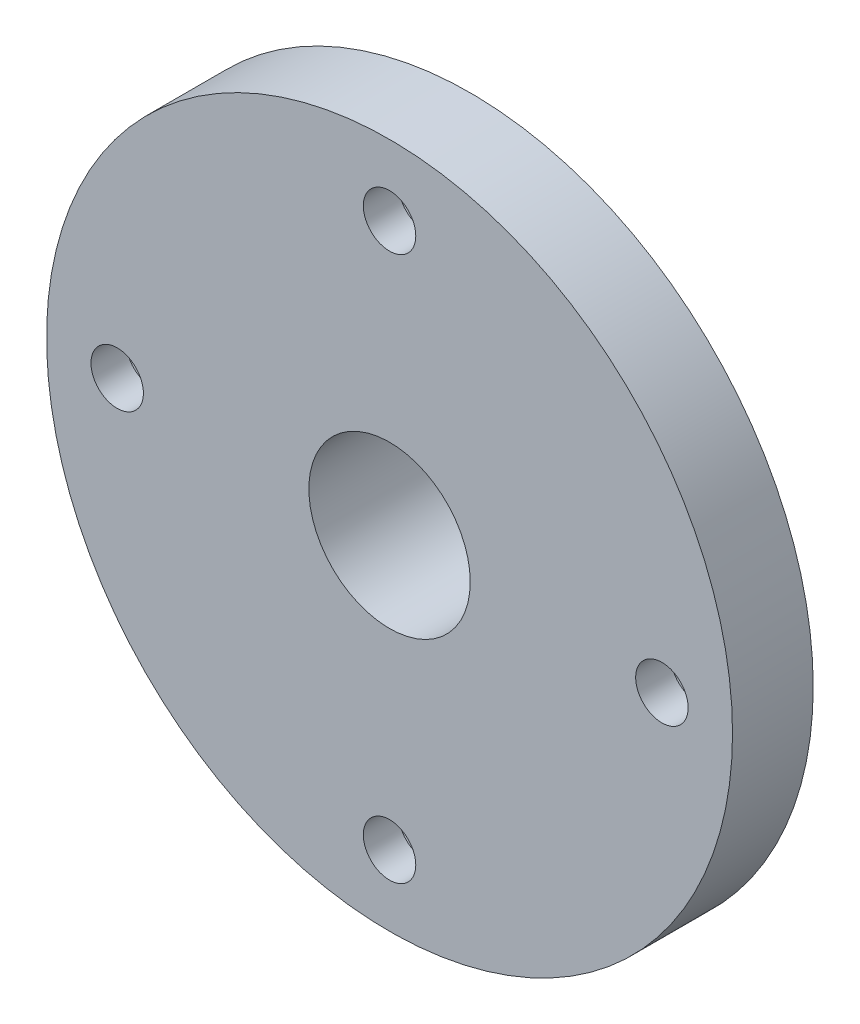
ISO-10303-21;
HEADER;
FILE_DESCRIPTION(('STEP AP214'),'2;1');
FILE_NAME('part.step','',(''),(''),'','','');
FILE_SCHEMA(('AUTOMOTIVE_DESIGN { 1 0 10303 214 1 1 1 1 }'));
ENDSEC;
DATA;
#1=APPLICATION_CONTEXT('core data for automotive mechanical design processes');
#2=APPLICATION_PROTOCOL_DEFINITION('international standard','automotive_design',2000,#1);
#3=PRODUCT_CONTEXT('',#1,'mechanical');
#4=PRODUCT('Part','Part','',(#3));
#5=PRODUCT_RELATED_PRODUCT_CATEGORY('part','',(#4));
#6=PRODUCT_DEFINITION_FORMATION('','',#4);
#7=PRODUCT_DEFINITION_CONTEXT('part definition',#1,'design');
#8=PRODUCT_DEFINITION('design','',#6,#7);
#9=PRODUCT_DEFINITION_SHAPE('','',#8);
#10=(LENGTH_UNIT() NAMED_UNIT(*) SI_UNIT(.MILLI.,.METRE.));
#11=(NAMED_UNIT(*) PLANE_ANGLE_UNIT() SI_UNIT($,.RADIAN.));
#12=(NAMED_UNIT(*) SI_UNIT($,.STERADIAN.) SOLID_ANGLE_UNIT());
#13=UNCERTAINTY_MEASURE_WITH_UNIT(LENGTH_MEASURE(1.E-05),#10,'distance_accuracy_value','');
#14=(GEOMETRIC_REPRESENTATION_CONTEXT(3) GLOBAL_UNCERTAINTY_ASSIGNED_CONTEXT((#13)) GLOBAL_UNIT_ASSIGNED_CONTEXT((#10,
#11,#12)) REPRESENTATION_CONTEXT('',''));
#15=CARTESIAN_POINT('',(0.,0.,0.));
#16=DIRECTION('',(0.,0.,1.));
#17=DIRECTION('',(1.,0.,0.));
#18=AXIS2_PLACEMENT_3D('',#15,#16,#17);
#19=CARTESIAN_POINT('',(0.,0.,0.));
#20=DIRECTION('',(0.,0.,1.));
#21=DIRECTION('',(1.,0.,0.));
#22=AXIS2_PLACEMENT_3D('',#19,#20,#21);
#23=CYLINDRICAL_SURFACE('',#22,12.5);
#24=CARTESIAN_POINT('',(0.,0.,-15.3507658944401));
#25=DIRECTION('',(0.,0.,1.));
#26=DIRECTION('',(1.,0.,0.));
#27=AXIS2_PLACEMENT_3D('',#24,#25,#26);
#28=CIRCLE('',#27,12.5);
#29=CARTESIAN_POINT('',(12.5,0.,-15.3507658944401));
#30=VERTEX_POINT('',#29);
#31=EDGE_CURVE('E57',#30,#30,#28,.F.);
#32=ORIENTED_EDGE('',*,*,#31,.T.);
#33=EDGE_LOOP('',(#32));
#34=FACE_BOUND('',#33,.T.);
#35=CARTESIAN_POINT('',(0.,0.,-18.));
#36=DIRECTION('',(0.,0.,1.));
#37=DIRECTION('',(1.,0.,0.));
#38=AXIS2_PLACEMENT_3D('',#35,#36,#37);
#39=CIRCLE('',#38,12.5);
#40=CARTESIAN_POINT('',(12.5,0.,-18.));
#41=VERTEX_POINT('',#40);
#42=EDGE_CURVE('E69',#41,#41,#39,.T.);
#43=ORIENTED_EDGE('',*,*,#42,.T.);
#44=EDGE_LOOP('',(#43));
#45=FACE_BOUND('',#44,.T.);
#46=ADVANCED_FACE('F43',(#34,#45),#23,.T.);
#47=CARTESIAN_POINT('',(0.,0.,-8.));
#48=DIRECTION('',(0.,0.,1.));
#49=DIRECTION('',(1.,0.,0.));
#50=AXIS2_PLACEMENT_3D('',#47,#48,#49);
#51=CONICAL_SURFACE('',#50,34.,1.43215658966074);
#52=CARTESIAN_POINT('',(-30.4903532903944,-3.58014439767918,-8.46048993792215));
#53=CARTESIAN_POINT('',(-30.5903932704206,-3.48261515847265,-8.44821315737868));
#54=CARTESIAN_POINT('',(-30.6863632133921,-3.38086891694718,-8.43648859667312));
#55=CARTESIAN_POINT('',(-30.8695290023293,-3.16958853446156,-8.41419365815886));
#56=CARTESIAN_POINT('',(-30.956722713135,-3.06005250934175,-8.4036235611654));
#57=CARTESIAN_POINT('',(-31.1217311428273,-2.83389212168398,-8.38368500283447));
#58=CARTESIAN_POINT('',(-31.1995381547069,-2.71726205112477,-8.37431752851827));
#59=CARTESIAN_POINT('',(-31.3451485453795,-2.47776722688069,-8.35683574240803));
#60=CARTESIAN_POINT('',(-31.4129482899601,-2.35490022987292,-8.34872188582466));
#61=CARTESIAN_POINT('',(-31.5379721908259,-2.10391380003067,-8.33379460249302));
#62=CARTESIAN_POINT('',(-31.5952025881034,-1.97579752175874,-8.32698040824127));
#63=CARTESIAN_POINT('',(-31.6987329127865,-1.71510520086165,-8.31467644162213));
#64=CARTESIAN_POINT('',(-31.7450287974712,-1.58252752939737,-8.30918715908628));
#65=CARTESIAN_POINT('',(-31.8262938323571,-1.31398470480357,-8.29956508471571));
#66=CARTESIAN_POINT('',(-31.8612698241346,-1.17802165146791,-8.29543147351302));
#67=CARTESIAN_POINT('',(-31.9196836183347,-0.903552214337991,-8.28853431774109));
#68=CARTESIAN_POINT('',(-31.9431171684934,-0.765044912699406,-8.28577127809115));
#69=CARTESIAN_POINT('',(-31.9781828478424,-0.487075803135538,-8.28163861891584));
#70=CARTESIAN_POINT('',(-31.9898608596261,-0.347619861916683,-8.28026358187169));
#71=CARTESIAN_POINT('',(-32.0014916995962,-0.0681613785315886,-8.27889409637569));
#72=CARTESIAN_POINT('',(-32.001440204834,0.0718413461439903,-8.27890015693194));
#73=CARTESIAN_POINT('',(-31.9896036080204,0.351294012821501,-8.28029387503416));
#74=CARTESIAN_POINT('',(-31.9778225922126,0.490744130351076,-8.28168105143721));
#75=CARTESIAN_POINT('',(-31.9426141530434,0.768197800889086,-8.28583058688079));
#76=CARTESIAN_POINT('',(-31.919182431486,0.906200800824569,-8.28859345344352));
#77=CARTESIAN_POINT('',(-31.8609027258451,1.17944883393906,-8.29547486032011));
#78=CARTESIAN_POINT('',(-31.8260778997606,1.31469887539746,-8.29959065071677));
#79=CARTESIAN_POINT('',(-31.7452435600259,1.58181722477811,-8.30916173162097));
#80=CARTESIAN_POINT('',(-31.6992299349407,1.71368426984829,-8.31461751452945));
#81=CARTESIAN_POINT('',(-31.5963734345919,1.97301588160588,-8.32684112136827));
#82=CARTESIAN_POINT('',(-31.5395345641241,2.10048205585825,-8.33360846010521));
#83=CARTESIAN_POINT('',(-31.4154427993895,2.35017861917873,-8.3484236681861));
#84=CARTESIAN_POINT('',(-31.3481860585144,2.47240705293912,-8.35647201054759));
#85=CARTESIAN_POINT('',(-31.1311906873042,2.83037926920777,-8.38252139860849));
#86=CARTESIAN_POINT('',(-30.9663564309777,3.05708430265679,-8.40241151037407));
#87=CARTESIAN_POINT('',(-30.6015658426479,3.47947078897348,-8.44680657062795));
#88=CARTESIAN_POINT('',(-30.40160871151,3.67515153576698,-8.47131162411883));
#89=CARTESIAN_POINT('',(-29.9710127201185,4.03131963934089,-8.52461951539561));
#90=CARTESIAN_POINT('',(-29.7402071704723,4.19160227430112,-8.55344581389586));
#91=CARTESIAN_POINT('',(-29.2554249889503,4.47117206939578,-8.61470526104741));
#92=CARTESIAN_POINT('',(-29.0014474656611,4.59045765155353,-8.64713854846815));
#93=CARTESIAN_POINT('',(-28.4755408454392,4.78560529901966,-8.71518056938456));
#94=CARTESIAN_POINT('',(-28.2034923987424,4.8611381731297,-8.75081110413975));
#95=CARTESIAN_POINT('',(-27.6508567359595,4.96542731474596,-8.82423558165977));
#96=CARTESIAN_POINT('',(-27.3702691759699,4.99418169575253,-8.86202961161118));
#97=CARTESIAN_POINT('',(-26.806479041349,5.00425636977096,-8.939136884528));
#98=CARTESIAN_POINT('',(-26.5232717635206,4.98524869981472,-8.97845879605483));
#99=CARTESIAN_POINT('',(-25.9641595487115,4.89969621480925,-9.05733624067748));
#100=CARTESIAN_POINT('',(-25.6882548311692,4.83314997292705,-9.09689178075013));
#101=CARTESIAN_POINT('',(-25.1505869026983,4.65405611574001,-9.17522647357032));
#102=CARTESIAN_POINT('',(-24.8888763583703,4.5413489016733,-9.21400243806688));
#103=CARTESIAN_POINT('',(-24.3881107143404,4.27302282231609,-9.28937740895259));
#104=CARTESIAN_POINT('',(-24.1490556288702,4.11740393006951,-9.3259764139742));
#105=CARTESIAN_POINT('',(-23.7010996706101,3.76798830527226,-9.39557704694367));
#106=CARTESIAN_POINT('',(-23.4921224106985,3.57429135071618,-9.42858773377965));
#107=CARTESIAN_POINT('',(-23.1097434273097,3.15382955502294,-9.48977800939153));
#108=CARTESIAN_POINT('',(-22.9363400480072,2.92706625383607,-9.51795782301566));
#109=CARTESIAN_POINT('',(-22.6318006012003,2.44915501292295,-9.56796870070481));
#110=CARTESIAN_POINT('',(-22.500279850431,2.19825830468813,-9.58985735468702));
#111=CARTESIAN_POINT('',(-22.28131457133,1.67743500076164,-9.626561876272));
#112=CARTESIAN_POINT('',(-22.1938664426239,1.40750996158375,-9.64137832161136));
#113=CARTESIAN_POINT('',(-22.0665993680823,0.859974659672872,-9.66301566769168));
#114=CARTESIAN_POINT('',(-22.0261892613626,0.582505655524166,-9.66993578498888));
#115=CARTESIAN_POINT('',(-21.9922589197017,0.0246378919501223,-9.67574303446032));
#116=CARTESIAN_POINT('',(-21.9987360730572,-0.255760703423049,-9.67463061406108));
#117=CARTESIAN_POINT('',(-22.0581352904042,-0.80922634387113,-9.66447523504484));
#118=CARTESIAN_POINT('',(-22.110696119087,-1.08233342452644,-9.65549395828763));
#119=CARTESIAN_POINT('',(-22.2601691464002,-1.61577040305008,-9.63015868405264));
#120=CARTESIAN_POINT('',(-22.3570817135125,-1.87610019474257,-9.61380462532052));
#121=CARTESIAN_POINT('',(-22.5926971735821,-2.37754517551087,-9.57448461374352));
#122=CARTESIAN_POINT('',(-22.7315343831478,-2.61859541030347,-9.55149742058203));
#123=CARTESIAN_POINT('',(-23.0469564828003,-3.07410057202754,-9.49997907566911));
#124=CARTESIAN_POINT('',(-23.223543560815,-3.28855395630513,-9.47144760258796));
#125=CARTESIAN_POINT('',(-23.5137808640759,-3.58691027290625,-9.42525962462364));
#126=CARTESIAN_POINT('',(-23.6154600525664,-3.68299393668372,-9.40918866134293));
#127=CARTESIAN_POINT('',(-23.8264058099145,-3.8662362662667,-9.37610201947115));
#128=CARTESIAN_POINT('',(-23.9356697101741,-3.95339804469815,-9.35908667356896));
#129=CARTESIAN_POINT('',(-24.1610639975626,-4.11824658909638,-9.32426306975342));
#130=CARTESIAN_POINT('',(-24.2771971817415,-4.19592945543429,-9.30645448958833));
#131=CARTESIAN_POINT('',(-24.5154405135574,-4.34124676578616,-9.27021397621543));
#132=CARTESIAN_POINT('',(-24.6375485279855,-4.40888476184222,-9.2517822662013));
#133=CARTESIAN_POINT('',(-24.8884380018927,-4.53444830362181,-9.214218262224));
#134=CARTESIAN_POINT('',(-25.0172822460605,-4.59224668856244,-9.19508019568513));
#135=CARTESIAN_POINT('',(-25.2793054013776,-4.69671110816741,-9.15647956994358));
#136=CARTESIAN_POINT('',(-25.4124827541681,-4.74338109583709,-9.13701712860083));
#137=CARTESIAN_POINT('',(-25.6823283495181,-4.82531147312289,-9.09790329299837));
#138=CARTESIAN_POINT('',(-25.8189978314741,-4.86056774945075,-9.07825183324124));
#139=CARTESIAN_POINT('',(-26.0947712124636,-4.91939341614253,-9.03891739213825));
#140=CARTESIAN_POINT('',(-26.2338742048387,-4.942967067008,-9.01923442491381));
#141=CARTESIAN_POINT('',(-26.5144691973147,-4.97839153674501,-8.97984265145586));
#142=CARTESIAN_POINT('',(-26.655970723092,-4.99016764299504,-8.96013446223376));
#143=CARTESIAN_POINT('',(-26.9394425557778,-5.00164448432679,-8.92095671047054));
#144=CARTESIAN_POINT('',(-27.0814126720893,-5.00134963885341,-8.90148706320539));
#145=CARTESIAN_POINT('',(-27.3649509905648,-4.98868336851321,-8.86289215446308));
#146=CARTESIAN_POINT('',(-27.5065188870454,-4.97630441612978,-8.84376711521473));
#147=CARTESIAN_POINT('',(-27.7880975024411,-4.93953989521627,-8.80599946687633));
#148=CARTESIAN_POINT('',(-27.9281087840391,-4.91515881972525,-8.78735668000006));
#149=CARTESIAN_POINT('',(-28.2056348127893,-4.85454630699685,-8.75065579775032));
#150=CARTESIAN_POINT('',(-28.3431493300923,-4.81831378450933,-8.73259775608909));
#151=CARTESIAN_POINT('',(-28.6146234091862,-4.7342555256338,-8.6971794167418));
#152=CARTESIAN_POINT('',(-28.7485842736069,-4.68643410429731,-8.67981886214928));
#153=CARTESIAN_POINT('',(-29.0119154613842,-4.5795597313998,-8.64590091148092));
#154=CARTESIAN_POINT('',(-29.1412897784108,-4.52051685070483,-8.62934281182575));
#155=CARTESIAN_POINT('',(-29.3945855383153,-4.39160046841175,-8.59710938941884));
#156=CARTESIAN_POINT('',(-29.5185084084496,-4.32172982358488,-8.58143383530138));
#157=CARTESIAN_POINT('',(-29.7924489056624,-4.15147383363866,-8.54696535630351));
#158=CARTESIAN_POINT('',(-29.9405536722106,-4.04792990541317,-8.5284635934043));
#159=CARTESIAN_POINT('',(-30.2248251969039,-3.82532249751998,-8.49316341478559));
#160=CARTESIAN_POINT('',(-30.3609919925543,-3.70625906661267,-8.47636499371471));
#161=CARTESIAN_POINT('',(-30.4903532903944,-3.58014439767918,-8.46048993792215));
#162=B_SPLINE_CURVE_WITH_KNOTS('',3,(#52,#53,#54,#55,#56,#57,#58,#59,#60,#61,#62,#63,#64,#65,
#66,#67,#68,#69,#70,#71,#72,#73,#74,#75,#76,#77,#78,#79,#80,#81,#82,#83,#84,#85,#86,#87,#88,#89,
#90,#91,#92,#93,#94,#95,#96,#97,#98,#99,#100,#101,#102,#103,#104,#105,#106,#107,#108,#109,#110,
#111,#112,#113,#114,#115,#116,#117,#118,#119,#120,#121,#122,#123,#124,#125,#126,#127,#128,#129,
#130,#131,#132,#133,#134,#135,#136,#137,#138,#139,#140,#141,#142,#143,#144,#145,#146,#147,#148,
#149,#150,#151,#152,#153,#154,#155,#156,#157,#158,#159,#160,#161),.UNSPECIFIED.,.T.,.F.,(4,2,2,
2,2,2,2,2,2,2,2,2,2,2,2,2,2,2,2,2,2,2,2,2,2,2,2,2,2,2,2,2,2,2,2,2,2,2,2,2,2,2,2,2,2,2,2,2,2,2,2,
2,2,2,4),(0.,0.420599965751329,0.84130201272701,1.26234716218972,1.6835448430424,
2.10449301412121,2.52559657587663,2.9464451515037,3.3674486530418,3.78680250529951,
4.20631091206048,4.62567322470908,5.04519036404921,5.46386002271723,5.88268375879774,
6.3013528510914,6.72017689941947,7.55886424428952,8.3975706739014,9.24100755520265,
10.0844768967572,10.9342126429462,11.7839826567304,12.6396036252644,13.49525027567,
14.3538805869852,15.2125114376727,16.0689216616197,16.9252920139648,17.7735533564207,
18.6217453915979,19.4591583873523,20.2965247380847,21.127385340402,21.9582528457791,
22.7918110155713,23.6254175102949,24.0474599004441,24.4693545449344,24.8914221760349,
25.3133401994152,25.7403536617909,26.1672152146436,26.594230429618,27.021089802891,
27.4506356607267,27.8800242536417,28.3096804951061,28.7391760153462,29.1687108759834,
29.5980860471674,30.0270776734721,30.4559563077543,30.9998341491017,31.5437102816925),.UNSPECIFIED.);
#163=CARTESIAN_POINT('',(-30.4903532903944,-3.58014439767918,-8.46048993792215));
#164=VERTEX_POINT('',#163);
#165=EDGE_CURVE('E47',#164,#164,#162,.T.);
#166=ORIENTED_EDGE('',*,*,#165,.F.);
#167=EDGE_LOOP('',(#166));
#168=FACE_BOUND('',#167,.T.);
#169=CARTESIAN_POINT('',(-3.55391758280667,23.4829419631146,-9.43018163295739));
#170=CARTESIAN_POINT('',(-3.75319385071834,23.684323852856,-9.39823713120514));
#171=CARTESIAN_POINT('',(-3.93529241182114,23.9026638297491,-9.36407165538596));
#172=CARTESIAN_POINT('',(-4.25991943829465,24.3668472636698,-9.29263605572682));
#173=CARTESIAN_POINT('',(-4.40239470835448,24.6127270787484,-9.25536184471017));
#174=CARTESIAN_POINT('',(-4.64358903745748,25.1246237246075,-9.17906452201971));
#175=CARTESIAN_POINT('',(-4.74234157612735,25.3906249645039,-9.1400427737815));
#176=CARTESIAN_POINT('',(-4.89349879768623,25.9353181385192,-9.0614523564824));
#177=CARTESIAN_POINT('',(-4.94591599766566,26.2140066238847,-9.02188383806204));
#178=CARTESIAN_POINT('',(-5.00309609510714,26.7774500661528,-8.94314137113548));
#179=CARTESIAN_POINT('',(-5.00766615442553,27.0622249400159,-8.90396965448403));
#180=CARTESIAN_POINT('',(-4.96843940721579,27.6286569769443,-8.82719748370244));
#181=CARTESIAN_POINT('',(-4.92464027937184,27.9103139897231,-8.78959710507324));
#182=CARTESIAN_POINT('',(-4.78987060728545,28.4620852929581,-8.71691723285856));
#183=CARTESIAN_POINT('',(-4.69895734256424,28.7322131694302,-8.6818347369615));
#184=CARTESIAN_POINT('',(-4.4724306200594,29.2534665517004,-8.61493238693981));
#185=CARTESIAN_POINT('',(-4.33681845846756,29.5045926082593,-8.58311243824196));
#186=CARTESIAN_POINT('',(-4.02555321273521,29.979087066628,-8.52359372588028));
#187=CARTESIAN_POINT('',(-3.85013890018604,30.2026091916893,-8.49587195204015));
#188=CARTESIAN_POINT('',(-3.46372382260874,30.6170251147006,-8.44489735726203));
#189=CARTESIAN_POINT('',(-3.25272454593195,30.8079202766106,-8.42164434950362));
#190=CARTESIAN_POINT('',(-2.80284369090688,31.1501007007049,-8.38022871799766));
#191=CARTESIAN_POINT('',(-2.5641852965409,31.3016748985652,-8.36202888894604));
#192=CARTESIAN_POINT('',(-2.06449319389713,31.5625980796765,-8.33083900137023));
#193=CARTESIAN_POINT('',(-1.80346032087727,31.6719486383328,-8.31784874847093));
#194=CARTESIAN_POINT('',(-1.26828765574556,31.8445826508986,-8.29739336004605));
#195=CARTESIAN_POINT('',(-0.994245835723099,31.9081656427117,-8.28989229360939));
#196=CARTESIAN_POINT('',(-0.439293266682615,31.988549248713,-8.28041555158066));
#197=CARTESIAN_POINT('',(-0.158382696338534,32.0053510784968,-8.27843973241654));
#198=CARTESIAN_POINT('',(0.401223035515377,31.9916999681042,-8.28004699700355));
#199=CARTESIAN_POINT('',(0.679922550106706,31.9614222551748,-8.28360946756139));
#200=CARTESIAN_POINT('',(1.22824455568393,31.8548345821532,-8.29618888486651));
#201=CARTESIAN_POINT('',(1.49786710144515,31.7785248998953,-8.30520579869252));
#202=CARTESIAN_POINT('',(2.02044978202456,31.5821078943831,-8.32852802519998));
#203=CARTESIAN_POINT('',(2.27340762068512,31.4619945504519,-8.34283406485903));
#204=CARTESIAN_POINT('',(2.75553139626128,31.1814869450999,-8.37646606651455));
#205=CARTESIAN_POINT('',(2.98469699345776,31.0210921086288,-8.39579210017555));
#206=CARTESIAN_POINT('',(3.41373019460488,30.6639668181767,-8.43918227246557));
#207=CARTESIAN_POINT('',(3.61347917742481,30.4670961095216,-8.46326472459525));
#208=CARTESIAN_POINT('',(3.97711176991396,30.0431211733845,-8.5156488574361));
#209=CARTESIAN_POINT('',(4.14099425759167,29.8160160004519,-8.54395067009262));
#210=CARTESIAN_POINT('',(4.42943127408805,29.3364406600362,-8.6044069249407));
#211=CARTESIAN_POINT('',(4.55371578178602,29.0838111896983,-8.63658583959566));
#212=CARTESIAN_POINT('',(4.75813370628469,28.5616598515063,-8.70396351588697));
#213=CARTESIAN_POINT('',(4.83826534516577,28.2921373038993,-8.73916239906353));
#214=CARTESIAN_POINT('',(4.95272334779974,27.7417124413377,-8.81207132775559));
#215=CARTESIAN_POINT('',(4.9867009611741,27.4607398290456,-8.84979825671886));
#216=CARTESIAN_POINT('',(5.00688851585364,26.8972676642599,-8.92661725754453));
#217=CARTESIAN_POINT('',(4.99309662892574,26.6147680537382,-8.96570938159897));
#218=CARTESIAN_POINT('',(4.91797317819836,26.0545562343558,-9.04446896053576));
#219=CARTESIAN_POINT('',(4.85636939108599,25.7768807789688,-9.08413842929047));
#220=CARTESIAN_POINT('',(4.68701772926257,25.2358525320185,-9.16268884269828));
#221=CARTESIAN_POINT('',(4.57926900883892,24.9725000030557,-9.20156977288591));
#222=CARTESIAN_POINT('',(4.3204476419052,24.4673417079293,-9.27734010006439));
#223=CARTESIAN_POINT('',(4.16932958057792,24.225558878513,-9.31422736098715));
#224=CARTESIAN_POINT('',(3.82796433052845,23.7708346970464,-9.38464267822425));
#225=CARTESIAN_POINT('',(3.63771781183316,23.5578928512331,-9.41817079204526));
#226=CARTESIAN_POINT('',(3.22457555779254,23.168254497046,-9.48033655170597));
#227=CARTESIAN_POINT('',(3.00187434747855,22.9913561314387,-9.50900127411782));
#228=CARTESIAN_POINT('',(2.52925036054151,22.6775779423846,-9.56039477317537));
#229=CARTESIAN_POINT('',(2.27932935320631,22.5406955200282,-9.58312393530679));
#230=CARTESIAN_POINT('',(1.76247054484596,22.3125091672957,-9.62130260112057));
#231=CARTESIAN_POINT('',(1.49576565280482,22.220691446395,-9.63683404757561));
#232=CARTESIAN_POINT('',(0.950420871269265,22.0831148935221,-9.66019571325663));
#233=CARTESIAN_POINT('',(0.671782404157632,22.0373505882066,-9.66802684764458));
#234=CARTESIAN_POINT('',(0.113968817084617,21.9935669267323,-9.67551810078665));
#235=CARTESIAN_POINT('',(-0.165161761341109,21.9949944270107,-9.67527288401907));
#236=CARTESIAN_POINT('',(-0.719256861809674,22.0441921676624,-9.66685738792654));
#237=CARTESIAN_POINT('',(-0.994220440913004,22.0919727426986,-9.65868534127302));
#238=CARTESIAN_POINT('',(-1.53134279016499,22.2322052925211,-9.63488597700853));
#239=CARTESIAN_POINT('',(-1.79353377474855,22.3245377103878,-9.61927861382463));
#240=CARTESIAN_POINT('',(-2.29841426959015,22.5509918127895,-9.58141381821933));
#241=CARTESIAN_POINT('',(-2.54112619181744,22.6850645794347,-9.55916417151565));
#242=CARTESIAN_POINT('',(-2.91197844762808,22.9319259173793,-9.51873805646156));
#243=CARTESIAN_POINT('',(-3.04824394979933,23.0330258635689,-9.50229297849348));
#244=CARTESIAN_POINT('',(-3.30968902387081,23.2483804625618,-9.46755669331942));
#245=CARTESIAN_POINT('',(-3.43486861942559,23.362635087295,-9.44926549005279));
#246=CARTESIAN_POINT('',(-3.55391758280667,23.4829419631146,-9.43018163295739));
#247=B_SPLINE_CURVE_WITH_KNOTS('',3,(#169,#170,#171,#172,#173,#174,#175,#176,#177,#178,#179,
#180,#181,#182,#183,#184,#185,#186,#187,#188,#189,#190,#191,#192,#193,#194,#195,#196,#197,#198,
#199,#200,#201,#202,#203,#204,#205,#206,#207,#208,#209,#210,#211,#212,#213,#214,#215,#216,#217,
#218,#219,#220,#221,#222,#223,#224,#225,#226,#227,#228,#229,#230,#231,#232,#233,#234,#235,#236,
#237,#238,#239,#240,#241,#242,#243,#244,#245,#246),.UNSPECIFIED.,.T.,.F.,(4,2,2,2,2,2,2,2,2,2,2,
2,2,2,2,2,2,2,2,2,2,2,2,2,2,2,2,2,2,2,2,2,2,2,2,2,2,2,4),(0.,0.854694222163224,1.71053041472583,
2.56571013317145,3.4206587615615,4.27905176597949,5.13748596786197,5.9948789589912,
6.85224708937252,7.70460185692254,8.55692098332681,9.40278740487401,10.248622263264,
11.0888697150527,11.9290953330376,12.7662011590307,13.6033019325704,14.4405178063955,
15.2777456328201,16.1182621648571,16.9588049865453,17.8049625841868,18.6511542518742,
19.5037050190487,20.3562884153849,21.2137620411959,22.0712513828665,22.9296419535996,
23.7880178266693,24.6414456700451,25.4948180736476,26.3382209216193,27.181523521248,
28.0149451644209,28.8485526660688,29.6799354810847,30.5103475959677,31.0209486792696,
31.5315486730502),.UNSPECIFIED.);
#248=CARTESIAN_POINT('',(-3.55391758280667,23.4829419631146,-9.43018163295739));
#249=VERTEX_POINT('',#248);
#250=EDGE_CURVE('E424',#249,#249,#247,.T.);
#251=ORIENTED_EDGE('',*,*,#250,.F.);
#252=EDGE_LOOP('',(#251));
#253=FACE_BOUND('',#252,.T.);
#254=CARTESIAN_POINT('',(23.4829419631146,-3.55391758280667,-9.43018163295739));
#255=CARTESIAN_POINT('',(23.2848411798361,-3.35785140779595,-9.46160563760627));
#256=CARTESIAN_POINT('',(23.1028550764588,-3.14487496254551,-9.49092648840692));
#257=CARTESIAN_POINT('',(22.7765838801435,-2.69091877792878,-9.54408257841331));
#258=CARTESIAN_POINT('',(22.632338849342,-2.44990967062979,-9.5679119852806));
#259=CARTESIAN_POINT('',(22.3859990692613,-1.94665105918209,-9.60894626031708));
#260=CARTESIAN_POINT('',(22.2839070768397,-1.68440016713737,-9.62615069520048));
#261=CARTESIAN_POINT('',(22.1250728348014,-1.14620642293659,-9.65304476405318));
#262=CARTESIAN_POINT('',(22.06831865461,-0.870267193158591,-9.66273637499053));
#263=CARTESIAN_POINT('',(22.0021705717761,-0.314984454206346,-9.67404158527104));
#264=CARTESIAN_POINT('',(21.9923790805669,-0.0356896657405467,-9.67572299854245));
#265=CARTESIAN_POINT('',(22.0193834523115,0.520573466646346,-9.67110023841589));
#266=CARTESIAN_POINT('',(22.056179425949,0.797541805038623,-9.66479604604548));
#267=CARTESIAN_POINT('',(22.1749483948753,1.34001236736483,-9.64458789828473));
#268=CARTESIAN_POINT('',(22.2567185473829,1.60556034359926,-9.63071806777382));
#269=CARTESIAN_POINT('',(22.4628236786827,2.11910118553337,-9.59611172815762));
#270=CARTESIAN_POINT('',(22.5871597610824,2.36709359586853,-9.57537504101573));
#271=CARTESIAN_POINT('',(22.8756991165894,2.84032657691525,-9.5278637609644));
#272=CARTESIAN_POINT('',(23.0401627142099,3.065404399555,-9.5010498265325));
#273=CARTESIAN_POINT('',(23.4037567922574,3.48483586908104,-9.44264041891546));
#274=CARTESIAN_POINT('',(23.6028894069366,3.67918762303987,-9.41104465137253));
#275=CARTESIAN_POINT('',(24.032886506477,4.03422041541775,-9.34389989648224));
#276=CARTESIAN_POINT('',(24.2641157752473,4.19445128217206,-9.30830651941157));
#277=CARTESIAN_POINT('',(24.7498422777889,4.4738464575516,-9.23477722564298));
#278=CARTESIAN_POINT('',(25.0043408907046,4.59300833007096,-9.1968411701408));
#279=CARTESIAN_POINT('',(25.5322241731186,4.7880697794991,-9.11945278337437));
#280=CARTESIAN_POINT('',(25.8057755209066,4.86351395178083,-9.07998890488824));
#281=CARTESIAN_POINT('',(26.3616946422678,4.96714393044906,-9.00108247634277));
#282=CARTESIAN_POINT('',(26.6440626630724,4.99532841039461,-8.96163992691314));
#283=CARTESIAN_POINT('',(27.2107157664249,5.00361712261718,-8.88368923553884));
#284=CARTESIAN_POINT('',(27.4950040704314,4.98354146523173,-8.84518513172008));
#285=CARTESIAN_POINT('',(28.0563226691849,4.89539498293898,-8.77022461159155));
#286=CARTESIAN_POINT('',(28.3333530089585,4.82732445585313,-8.73376818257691));
#287=CARTESIAN_POINT('',(28.8714531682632,4.64522630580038,-8.66384352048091));
#288=CARTESIAN_POINT('',(29.1325631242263,4.53132026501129,-8.63036766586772));
#289=CARTESIAN_POINT('',(29.6320208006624,4.26064993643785,-8.56703107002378));
#290=CARTESIAN_POINT('',(29.8703692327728,4.10388698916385,-8.53717021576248));
#291=CARTESIAN_POINT('',(30.3158132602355,3.75303032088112,-8.48187384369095));
#292=CARTESIAN_POINT('',(30.5231038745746,3.55918859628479,-8.45641054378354));
#293=CARTESIAN_POINT('',(30.9021805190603,3.13895679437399,-8.41018394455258));
#294=CARTESIAN_POINT('',(31.0739679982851,2.91256804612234,-8.38942045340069));
#295=CARTESIAN_POINT('',(31.3757696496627,2.4355099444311,-8.35313969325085));
#296=CARTESIAN_POINT('',(31.506089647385,2.18503697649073,-8.33758396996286));
#297=CARTESIAN_POINT('',(31.7228451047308,1.66551666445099,-8.31180120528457));
#298=CARTESIAN_POINT('',(31.8092821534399,1.39646999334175,-8.30157397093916));
#299=CARTESIAN_POINT('',(31.9353086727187,0.849181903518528,-8.28668633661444));
#300=CARTESIAN_POINT('',(31.9751768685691,0.571005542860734,-8.28199281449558));
#301=CARTESIAN_POINT('',(32.0078216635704,0.0118669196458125,-8.27814857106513));
#302=CARTESIAN_POINT('',(32.0005992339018,-0.26909528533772,-8.27899773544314));
#303=CARTESIAN_POINT('',(31.939368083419,-0.825002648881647,-8.28621239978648));
#304=CARTESIAN_POINT('',(31.8854896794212,-1.09996238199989,-8.2925625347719));
#305=CARTESIAN_POINT('',(31.7327028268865,-1.6368921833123,-8.31064187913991));
#306=CARTESIAN_POINT('',(31.6337944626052,-1.89886227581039,-8.32237107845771));
#307=CARTESIAN_POINT('',(31.3937510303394,-2.40269820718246,-8.35100147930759));
#308=CARTESIAN_POINT('',(31.2525676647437,-2.6445406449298,-8.36790859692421));
#309=CARTESIAN_POINT('',(30.9319865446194,-3.10115969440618,-8.40658893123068));
#310=CARTESIAN_POINT('',(30.7525879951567,-3.31593574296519,-8.42836224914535));
#311=CARTESIAN_POINT('',(30.4585484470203,-3.61360280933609,-8.46437781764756));
#312=CARTESIAN_POINT('',(30.3560458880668,-3.70898196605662,-8.4769835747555));
#313=CARTESIAN_POINT('',(30.1434994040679,-3.89074901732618,-8.50324867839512));
#314=CARTESIAN_POINT('',(30.0334581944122,-3.97714012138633,-8.51690764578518));
#315=CARTESIAN_POINT('',(29.8065744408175,-4.14037297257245,-8.54521689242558));
#316=CARTESIAN_POINT('',(29.6897292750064,-4.21721100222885,-8.55986755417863));
#317=CARTESIAN_POINT('',(29.4501458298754,-4.36076567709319,-8.59007627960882));
#318=CARTESIAN_POINT('',(29.3274096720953,-4.42748593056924,-8.60563401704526));
#319=CARTESIAN_POINT('',(29.0759369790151,-4.55085129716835,-8.63770050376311));
#320=CARTESIAN_POINT('',(28.9471623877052,-4.60741720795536,-8.65421550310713));
#321=CARTESIAN_POINT('',(28.6854415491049,-4.70945934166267,-8.68799436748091));
#322=CARTESIAN_POINT('',(28.552496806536,-4.75493951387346,-8.70525796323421));
#323=CARTESIAN_POINT('',(28.2832859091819,-4.83455142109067,-8.74045060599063));
#324=CARTESIAN_POINT('',(28.1470185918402,-4.86867912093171,-8.7583798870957));
#325=CARTESIAN_POINT('',(27.8722184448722,-4.92533342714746,-8.79478972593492));
#326=CARTESIAN_POINT('',(27.7336864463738,-4.94786419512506,-8.8132700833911));
#327=CARTESIAN_POINT('',(27.4542202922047,-4.98132906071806,-8.85082237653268));
#328=CARTESIAN_POINT('',(27.3132758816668,-4.99217371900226,-8.86989774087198));
#329=CARTESIAN_POINT('',(27.0310724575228,-5.00189573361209,-8.9083801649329));
#330=CARTESIAN_POINT('',(26.889813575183,-5.00077738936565,-8.92778710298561));
#331=CARTESIAN_POINT('',(26.6078361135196,-4.98659684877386,-8.96682769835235));
#332=CARTESIAN_POINT('',(26.4671179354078,-4.97352704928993,-8.9864614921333));
#333=CARTESIAN_POINT('',(26.187354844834,-4.93553731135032,-9.02580515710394));
#334=CARTESIAN_POINT('',(26.0483093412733,-4.91062169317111,-9.04551499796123));
#335=CARTESIAN_POINT('',(25.7720362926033,-4.84894322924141,-9.08499158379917));
#336=CARTESIAN_POINT('',(25.6348234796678,-4.81211416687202,-9.10475802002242));
#337=CARTESIAN_POINT('',(25.3640515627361,-4.72692399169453,-9.14408157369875));
#338=CARTESIAN_POINT('',(25.2304911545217,-4.67856705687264,-9.16363876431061));
#339=CARTESIAN_POINT('',(24.9680318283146,-4.57069088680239,-9.20238231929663));
#340=CARTESIAN_POINT('',(24.8391290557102,-4.51118114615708,-9.22156898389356));
#341=CARTESIAN_POINT('',(24.5868319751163,-4.3814094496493,-9.25942322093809));
#342=CARTESIAN_POINT('',(24.4634362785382,-4.31115022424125,-9.27809092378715));
#343=CARTESIAN_POINT('',(24.1880617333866,-4.13841830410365,-9.32007857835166));
#344=CARTESIAN_POINT('',(24.0381808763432,-4.03251439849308,-9.34317635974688));
#345=CARTESIAN_POINT('',(23.7508510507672,-3.80482415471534,-9.38788068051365));
#346=CARTESIAN_POINT('',(23.6134020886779,-3.68303780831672,-9.40948721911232));
#347=CARTESIAN_POINT('',(23.4829419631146,-3.55391758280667,-9.43018163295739));
#348=B_SPLINE_CURVE_WITH_KNOTS('',3,(#254,#255,#256,#257,#258,#259,#260,#261,#262,#263,#264,
#265,#266,#267,#268,#269,#270,#271,#272,#273,#274,#275,#276,#277,#278,#279,#280,#281,#282,#283,
#284,#285,#286,#287,#288,#289,#290,#291,#292,#293,#294,#295,#296,#297,#298,#299,#300,#301,#302,
#303,#304,#305,#306,#307,#308,#309,#310,#311,#312,#313,#314,#315,#316,#317,#318,#319,#320,#321,
#322,#323,#324,#325,#326,#327,#328,#329,#330,#331,#332,#333,#334,#335,#336,#337,#338,#339,#340,
#341,#342,#343,#344,#345,#346,#347),.UNSPECIFIED.,.T.,.F.,(4,2,2,2,2,2,2,2,2,2,2,2,2,2,2,2,2,2,
2,2,2,2,2,2,2,2,2,2,2,2,2,2,2,2,2,2,2,2,2,2,2,2,2,2,2,2,4),(0.,0.840826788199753,
1.68254252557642,2.5243133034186,3.36586249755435,4.2002743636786,5.03468821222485,
5.86536918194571,6.6960716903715,7.53231372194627,8.36860725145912,9.21533101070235,
10.062104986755,10.9175481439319,11.7730153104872,12.6316761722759,13.4903317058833,
14.3467244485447,15.2030904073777,16.0538307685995,16.9045363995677,17.7488142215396,
18.5930614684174,19.432229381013,20.2713799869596,21.1081942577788,21.9450069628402,
22.782779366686,23.620569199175,24.0419045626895,24.463088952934,24.88443673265,
25.3056338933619,25.7299856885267,26.1541860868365,26.5785371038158,27.0027357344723,
27.4301583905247,27.857427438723,28.2849684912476,28.7123537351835,29.1421564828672,
29.5718036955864,30.001086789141,30.4302610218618,30.9839908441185,31.53772095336),.UNSPECIFIED.);
#349=CARTESIAN_POINT('',(23.4829419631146,-3.55391758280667,-9.43018163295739));
#350=VERTEX_POINT('',#349);
#351=EDGE_CURVE('E113',#350,#350,#348,.T.);
#352=ORIENTED_EDGE('',*,*,#351,.F.);
#353=EDGE_LOOP('',(#352));
#354=FACE_BOUND('',#353,.T.);
#355=CARTESIAN_POINT('',(-3.58014439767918,-30.4903532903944,-8.46048993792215));
#356=CARTESIAN_POINT('',(-3.67871921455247,-30.3892438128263,-8.47289796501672));
#357=CARTESIAN_POINT('',(-3.77296282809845,-30.2840012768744,-8.48586707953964));
#358=CARTESIAN_POINT('',(-3.95218273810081,-30.0659692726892,-8.51286874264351));
#359=CARTESIAN_POINT('',(-4.03715641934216,-29.9531776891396,-8.52690158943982));
#360=CARTESIAN_POINT('',(-4.1972870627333,-29.7207927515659,-8.55596878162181));
#361=CARTESIAN_POINT('',(-4.27243454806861,-29.6011929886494,-8.57100407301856));
#362=CARTESIAN_POINT('',(-4.41232943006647,-29.3561121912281,-8.60199157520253));
#363=CARTESIAN_POINT('',(-4.477072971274,-29.2306289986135,-8.61794412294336));
#364=CARTESIAN_POINT('',(-4.59561683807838,-28.9748792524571,-8.65065679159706));
#365=CARTESIAN_POINT('',(-4.64942989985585,-28.8446184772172,-8.66741594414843));
#366=CARTESIAN_POINT('',(-4.74586617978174,-28.5800583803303,-8.70167424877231));
#367=CARTESIAN_POINT('',(-4.78848527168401,-28.4457575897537,-8.71917367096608));
#368=CARTESIAN_POINT('',(-4.86220395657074,-28.1742037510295,-8.75479785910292));
#369=CARTESIAN_POINT('',(-4.89331070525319,-28.0369525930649,-8.7729222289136));
#370=CARTESIAN_POINT('',(-4.9438512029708,-27.7603358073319,-8.8097092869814));
#371=CARTESIAN_POINT('',(-4.96328062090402,-27.6209694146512,-8.82837217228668));
#372=CARTESIAN_POINT('',(-4.99039635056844,-27.3404437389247,-8.86621454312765));
#373=CARTESIAN_POINT('',(-4.99802276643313,-27.1992789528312,-8.88539616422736));
#374=CARTESIAN_POINT('',(-5.00130348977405,-26.9168004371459,-8.92407249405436));
#375=CARTESIAN_POINT('',(-4.99695336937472,-26.7754866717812,-8.943567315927));
#376=CARTESIAN_POINT('',(-4.97631387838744,-26.4938010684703,-8.98273099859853));
#377=CARTESIAN_POINT('',(-4.96002804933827,-26.3534289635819,-9.00239980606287));
#378=CARTESIAN_POINT('',(-4.91563185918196,-26.0745209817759,-9.04179134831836));
#379=CARTESIAN_POINT('',(-4.88751712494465,-25.935985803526,-9.06151410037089));
#380=CARTESIAN_POINT('',(-4.81951751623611,-25.6612077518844,-9.1009484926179));
#381=CARTESIAN_POINT('',(-4.77958413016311,-25.5249768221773,-9.12065974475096));
#382=CARTESIAN_POINT('',(-4.68825468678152,-25.2563234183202,-9.15984695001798));
#383=CARTESIAN_POINT('',(-4.63685438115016,-25.1239023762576,-9.17932281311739));
#384=CARTESIAN_POINT('',(-4.52296501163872,-24.8639026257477,-9.21787201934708));
#385=CARTESIAN_POINT('',(-4.46047992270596,-24.7363222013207,-9.23694550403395));
#386=CARTESIAN_POINT('',(-4.32484844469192,-24.4868581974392,-9.27453800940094));
#387=CARTESIAN_POINT('',(-4.25169813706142,-24.3649767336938,-9.29305682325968));
#388=CARTESIAN_POINT('',(-4.01716085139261,-24.0095592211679,-9.34748346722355));
#389=CARTESIAN_POINT('',(-3.84044823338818,-23.7857048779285,-9.3823425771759));
#390=CARTESIAN_POINT('',(-3.45131511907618,-23.37103659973,-9.44782008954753));
#391=CARTESIAN_POINT('',(-3.23889593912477,-23.1802214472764,-9.47843864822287));
#392=CARTESIAN_POINT('',(-2.78603269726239,-22.838535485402,-9.53391256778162));
#393=CARTESIAN_POINT('',(-2.54582622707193,-22.6873575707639,-9.55881204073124));
#394=CARTESIAN_POINT('',(-2.0428523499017,-22.4275971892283,-9.60197213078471));
#395=CARTESIAN_POINT('',(-1.78008666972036,-22.3190114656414,-9.62023325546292));
#396=CARTESIAN_POINT('',(-1.24298784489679,-22.1488831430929,-9.64899437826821));
#397=CARTESIAN_POINT('',(-0.96884172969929,-22.0867661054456,-9.65958909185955));
#398=CARTESIAN_POINT('',(-0.413838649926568,-22.0092854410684,-9.67282151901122));
#399=CARTESIAN_POINT('',(-0.132982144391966,-21.9939186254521,-9.67545977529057));
#400=CARTESIAN_POINT('',(0.424571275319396,-22.0103331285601,-9.6726493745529));
#401=CARTESIAN_POINT('',(0.701282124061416,-22.0416590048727,-9.66727883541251));
#402=CARTESIAN_POINT('',(1.24543689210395,-22.149656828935,-9.64888299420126));
#403=CARTESIAN_POINT('',(1.51288086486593,-22.2263285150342,-9.63585773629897));
#404=CARTESIAN_POINT('',(2.03115556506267,-22.4227460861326,-9.60281551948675));
#405=CARTESIAN_POINT('',(2.28197658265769,-22.5425168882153,-9.5827945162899));
#406=CARTESIAN_POINT('',(2.75995864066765,-22.8215761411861,-9.53672788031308));
#407=CARTESIAN_POINT('',(2.98711852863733,-22.9808665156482,-9.51068195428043));
#408=CARTESIAN_POINT('',(3.41386159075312,-23.3362003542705,-9.45341852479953));
#409=CARTESIAN_POINT('',(3.61313803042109,-23.5326040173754,-9.42215071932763));
#410=CARTESIAN_POINT('',(3.97598316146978,-23.9554654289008,-9.35589683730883));
#411=CARTESIAN_POINT('',(4.1395495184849,-24.1819251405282,-9.32091051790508));
#412=CARTESIAN_POINT('',(4.42841749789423,-24.6615302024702,-9.24803208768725));
#413=CARTESIAN_POINT('',(4.55322226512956,-24.914970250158,-9.21010945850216));
#414=CARTESIAN_POINT('',(4.75842881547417,-25.4390519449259,-9.13299418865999));
#415=CARTESIAN_POINT('',(4.83882851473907,-25.7096943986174,-9.09380148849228));
#416=CARTESIAN_POINT('',(4.95346009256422,-26.2627237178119,-9.01500716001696));
#417=CARTESIAN_POINT('',(4.98733685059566,-26.5451841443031,-8.97540468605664));
#418=CARTESIAN_POINT('',(5.00678191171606,-27.1119016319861,-8.89716768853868));
#419=CARTESIAN_POINT('',(4.99234958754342,-27.3961587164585,-8.85853317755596));
#420=CARTESIAN_POINT('',(4.91545993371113,-27.9585776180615,-8.7831737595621));
#421=CARTESIAN_POINT('',(4.85296825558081,-28.2367349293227,-8.74645023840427));
#422=CARTESIAN_POINT('',(4.68154289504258,-28.7787413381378,-8.67580205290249));
#423=CARTESIAN_POINT('',(4.57261014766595,-29.042590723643,-8.64187733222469));
#424=CARTESIAN_POINT('',(4.31193202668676,-29.5470619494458,-8.57773420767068));
#425=CARTESIAN_POINT('',(4.16039177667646,-29.7877878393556,-8.54749901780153));
#426=CARTESIAN_POINT('',(3.81831872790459,-30.240493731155,-8.49116953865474));
#427=CARTESIAN_POINT('',(3.62778731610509,-30.452474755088,-8.46507510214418));
#428=CARTESIAN_POINT('',(3.31787574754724,-30.7432180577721,-8.42955416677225));
#429=CARTESIAN_POINT('',(3.21092930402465,-30.8353452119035,-8.41834714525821));
#430=CARTESIAN_POINT('',(2.98957192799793,-31.0102767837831,-8.3971409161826));
#431=CARTESIAN_POINT('',(2.87516385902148,-31.0930847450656,-8.38714124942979));
#432=CARTESIAN_POINT('',(2.63964752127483,-31.248788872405,-8.36839541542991));
#433=CARTESIAN_POINT('',(2.51853693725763,-31.3216815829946,-8.35964968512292));
#434=CARTESIAN_POINT('',(2.27055724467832,-31.4569616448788,-8.34346000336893));
#435=CARTESIAN_POINT('',(2.14369033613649,-31.5193529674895,-8.33601555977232));
#436=CARTESIAN_POINT('',(1.88594466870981,-31.6328075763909,-8.32250647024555));
#437=CARTESIAN_POINT('',(1.75509881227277,-31.6839445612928,-8.31643284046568));
#438=CARTESIAN_POINT('',(1.48956877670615,-31.7750264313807,-8.30563222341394));
#439=CARTESIAN_POINT('',(1.35488606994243,-31.8149755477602,-8.30090472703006));
#440=CARTESIAN_POINT('',(1.08255649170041,-31.8834198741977,-8.29281436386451));
#441=CARTESIAN_POINT('',(0.944908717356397,-31.9119115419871,-8.28945191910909));
#442=CARTESIAN_POINT('',(0.667728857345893,-31.9572018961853,-8.28411054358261));
#443=CARTESIAN_POINT('',(0.528197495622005,-31.9740049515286,-8.28213109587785));
#444=CARTESIAN_POINT('',(0.2488308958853,-31.9957607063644,-8.27956871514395));
#445=CARTESIAN_POINT('',(0.108999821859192,-32.000766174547,-8.27897956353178));
#446=CARTESIAN_POINT('',(-0.170537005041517,-31.9990444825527,-8.27918226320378));
#447=CARTESIAN_POINT('',(-0.31024278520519,-31.9923216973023,-8.27997359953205));
#448=CARTESIAN_POINT('',(-0.588670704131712,-31.9671940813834,-8.28293351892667));
#449=CARTESIAN_POINT('',(-0.727392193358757,-31.9487821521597,-8.2851029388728));
#450=CARTESIAN_POINT('',(-1.00272669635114,-31.9004152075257,-8.29080866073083));
#451=CARTESIAN_POINT('',(-1.13934046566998,-31.8704644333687,-8.29434446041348));
#452=CARTESIAN_POINT('',(-1.4095099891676,-31.799249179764,-8.30276556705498));
#453=CARTESIAN_POINT('',(-1.5430664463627,-31.7579873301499,-8.30765056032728));
#454=CARTESIAN_POINT('',(-1.80616040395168,-31.6644687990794,-8.31874554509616));
#455=CARTESIAN_POINT('',(-1.93569934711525,-31.612216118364,-8.32495505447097));
#456=CARTESIAN_POINT('',(-2.18978474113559,-31.4971406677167,-8.33866513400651));
#457=CARTESIAN_POINT('',(-2.31433555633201,-31.4343273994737,-8.34616454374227));
#458=CARTESIAN_POINT('',(-2.55765577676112,-31.2985816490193,-8.36242010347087));
#459=CARTESIAN_POINT('',(-2.67642669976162,-31.2256518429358,-8.37117592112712));
#460=CARTESIAN_POINT('',(-2.9341991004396,-31.0521446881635,-8.39207836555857));
#461=CARTESIAN_POINT('',(-3.07150825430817,-30.949077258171,-8.40454051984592));
#462=CARTESIAN_POINT('',(-3.33471586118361,-30.7294833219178,-8.43122343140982));
#463=CARTESIAN_POINT('',(-3.46061433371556,-30.612956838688,-8.44544418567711));
#464=CARTESIAN_POINT('',(-3.58014439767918,-30.4903532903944,-8.46048993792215));
#465=B_SPLINE_CURVE_WITH_KNOTS('',3,(#355,#356,#357,#358,#359,#360,#361,#362,#363,#364,#365,
#366,#367,#368,#369,#370,#371,#372,#373,#374,#375,#376,#377,#378,#379,#380,#381,#382,#383,#384,
#385,#386,#387,#388,#389,#390,#391,#392,#393,#394,#395,#396,#397,#398,#399,#400,#401,#402,#403,
#404,#405,#406,#407,#408,#409,#410,#411,#412,#413,#414,#415,#416,#417,#418,#419,#420,#421,#422,
#423,#424,#425,#426,#427,#428,#429,#430,#431,#432,#433,#434,#435,#436,#437,#438,#439,#440,#441,
#442,#443,#444,#445,#446,#447,#448,#449,#450,#451,#452,#453,#454,#455,#456,#457,#458,#459,#460,
#461,#462,#463,#464),.UNSPECIFIED.,.T.,.F.,(4,2,2,2,2,2,2,2,2,2,2,2,2,2,2,2,2,2,2,2,2,2,2,2,2,2,
2,2,2,2,2,2,2,2,2,2,2,2,2,2,2,2,2,2,2,2,2,2,2,2,2,2,2,2,4),(0.,0.42510861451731,
0.850336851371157,1.27597221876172,1.70176495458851,2.12705867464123,2.55250894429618,
2.97769432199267,3.40303730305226,3.83053174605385,4.25818426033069,4.68570993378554,
5.11339380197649,5.54285810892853,5.97248179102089,6.40195172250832,6.8315798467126,
7.689056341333,8.5465012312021,9.39709207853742,10.2476178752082,11.0874475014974,
11.9272198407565,12.7588544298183,13.5904842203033,14.4225955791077,15.2547474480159,
16.0954342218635,16.9361759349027,17.7872876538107,18.6384393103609,19.4960525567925,
20.3536769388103,21.2119148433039,22.0701354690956,22.9242931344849,23.778420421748,
24.2028038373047,24.627025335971,25.0513942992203,25.4756024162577,25.8969440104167,
26.3181260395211,26.7394381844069,27.1605927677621,27.5798599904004,27.998970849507,
28.4183364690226,28.8375480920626,29.2566623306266,29.6756242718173,30.0942112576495,
30.5126877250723,31.0281677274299,31.5436468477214),.UNSPECIFIED.);
#466=CARTESIAN_POINT('',(-3.58014439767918,-30.4903532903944,-8.46048993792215));
#467=VERTEX_POINT('',#466);
#468=EDGE_CURVE('E105',#467,#467,#465,.T.);
#469=ORIENTED_EDGE('',*,*,#468,.F.);
#470=EDGE_LOOP('',(#469));
#471=FACE_BOUND('',#470,.T.);
#472=CARTESIAN_POINT('',(0.,0.,-10.3987414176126));
#473=DIRECTION('',(0.,0.,1.));
#474=DIRECTION('',(1.,0.,0.));
#475=AXIS2_PLACEMENT_3D('',#472,#473,#474);
#476=CIRCLE('',#475,16.8090198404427);
#477=CARTESIAN_POINT('',(16.8090198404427,0.,-10.3987414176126));
#478=VERTEX_POINT('',#477);
#479=EDGE_CURVE('E63',#478,#478,#476,.T.);
#480=ORIENTED_EDGE('',*,*,#479,.T.);
#481=EDGE_LOOP('',(#480));
#482=FACE_BOUND('',#481,.T.);
#483=CARTESIAN_POINT('',(0.,0.,-8.));
#484=DIRECTION('',(0.,0.,1.));
#485=DIRECTION('',(1.,0.,0.));
#486=AXIS2_PLACEMENT_3D('',#483,#484,#485);
#487=CIRCLE('',#486,34.);
#488=CARTESIAN_POINT('',(34.,0.,-8.));
#489=VERTEX_POINT('',#488);
#490=EDGE_CURVE('E81',#489,#489,#487,.T.);
#491=ORIENTED_EDGE('',*,*,#490,.F.);
#492=EDGE_LOOP('',(#491));
#493=FACE_BOUND('',#492,.T.);
#494=ADVANCED_FACE('F118',(#168,#253,#354,#471,#482,#493),#51,.T.);
#495=CARTESIAN_POINT('',(0.,0.,0.));
#496=DIRECTION('',(0.,0.,1.));
#497=DIRECTION('',(1.,0.,0.));
#498=AXIS2_PLACEMENT_3D('',#495,#496,#497);
#499=CYLINDRICAL_SURFACE('',#498,34.);
#500=ORIENTED_EDGE('',*,*,#490,.T.);
#501=EDGE_LOOP('',(#500));
#502=FACE_BOUND('',#501,.T.);
#503=CARTESIAN_POINT('',(0.,0.,0.));
#504=DIRECTION('',(0.,0.,1.));
#505=DIRECTION('',(1.,0.,0.));
#506=AXIS2_PLACEMENT_3D('',#503,#504,#505);
#507=CIRCLE('',#506,34.);
#508=CARTESIAN_POINT('',(34.,0.,0.));
#509=VERTEX_POINT('',#508);
#510=EDGE_CURVE('E77',#509,#509,#507,.T.);
#511=ORIENTED_EDGE('',*,*,#510,.F.);
#512=EDGE_LOOP('',(#511));
#513=FACE_BOUND('',#512,.T.);
#514=ADVANCED_FACE('F168',(#502,#513),#499,.T.);
#515=CARTESIAN_POINT('',(34.,0.,0.));
#516=DIRECTION('',(0.,0.,1.));
#517=DIRECTION('',(1.,0.,0.));
#518=AXIS2_PLACEMENT_3D('',#515,#516,#517);
#519=PLANE('',#518);
#520=CARTESIAN_POINT('',(-27.,0.,0.));
#521=DIRECTION('',(0.,0.,1.));
#522=DIRECTION('',(1.,0.,0.));
#523=AXIS2_PLACEMENT_3D('',#520,#521,#522);
#524=CIRCLE('',#523,2.6);
#525=CARTESIAN_POINT('',(-24.4,0.,0.));
#526=VERTEX_POINT('',#525);
#527=EDGE_CURVE('E452',#526,#526,#524,.T.);
#528=ORIENTED_EDGE('',*,*,#527,.F.);
#529=EDGE_LOOP('',(#528));
#530=FACE_BOUND('',#529,.T.);
#531=CARTESIAN_POINT('',(0.,27.,0.));
#532=DIRECTION('',(0.,0.,1.));
#533=DIRECTION('',(1.,0.,0.));
#534=AXIS2_PLACEMENT_3D('',#531,#532,#533);
#535=CIRCLE('',#534,2.6);
#536=CARTESIAN_POINT('',(2.6,27.,0.));
#537=VERTEX_POINT('',#536);
#538=EDGE_CURVE('E457',#537,#537,#535,.T.);
#539=ORIENTED_EDGE('',*,*,#538,.F.);
#540=EDGE_LOOP('',(#539));
#541=FACE_BOUND('',#540,.T.);
#542=CARTESIAN_POINT('',(27.,0.,0.));
#543=DIRECTION('',(0.,0.,1.));
#544=DIRECTION('',(1.,0.,0.));
#545=AXIS2_PLACEMENT_3D('',#542,#543,#544);
#546=CIRCLE('',#545,2.6);
#547=CARTESIAN_POINT('',(29.6,0.,0.));
#548=VERTEX_POINT('',#547);
#549=EDGE_CURVE('E461',#548,#548,#546,.T.);
#550=ORIENTED_EDGE('',*,*,#549,.F.);
#551=EDGE_LOOP('',(#550));
#552=FACE_BOUND('',#551,.T.);
#553=CARTESIAN_POINT('',(0.,-27.,0.));
#554=DIRECTION('',(0.,0.,1.));
#555=DIRECTION('',(1.,0.,0.));
#556=AXIS2_PLACEMENT_3D('',#553,#554,#555);
#557=CIRCLE('',#556,2.6);
#558=CARTESIAN_POINT('',(2.6,-27.,0.));
#559=VERTEX_POINT('',#558);
#560=EDGE_CURVE('E434',#559,#559,#557,.T.);
#561=ORIENTED_EDGE('',*,*,#560,.F.);
#562=EDGE_LOOP('',(#561));
#563=FACE_BOUND('',#562,.T.);
#564=ORIENTED_EDGE('',*,*,#510,.T.);
#565=EDGE_LOOP('',(#564));
#566=FACE_BOUND('',#565,.T.);
#567=CARTESIAN_POINT('',(0.,0.,0.));
#568=DIRECTION('',(0.,0.,1.));
#569=DIRECTION('',(1.,0.,0.));
#570=AXIS2_PLACEMENT_3D('',#567,#568,#569);
#571=CIRCLE('',#570,8.);
#572=CARTESIAN_POINT('',(8.,0.,0.));
#573=VERTEX_POINT('',#572);
#574=EDGE_CURVE('E73',#573,#573,#571,.T.);
#575=ORIENTED_EDGE('',*,*,#574,.F.);
#576=EDGE_LOOP('',(#575));
#577=FACE_BOUND('',#576,.T.);
#578=ADVANCED_FACE('F165',(#530,#541,#552,#563,#566,#577),#519,.T.);
#579=CARTESIAN_POINT('',(0.,0.,0.));
#580=DIRECTION('',(0.,0.,1.));
#581=DIRECTION('',(1.,0.,0.));
#582=AXIS2_PLACEMENT_3D('',#579,#580,#581);
#583=CYLINDRICAL_SURFACE('',#582,8.);
#584=ORIENTED_EDGE('',*,*,#574,.T.);
#585=EDGE_LOOP('',(#584));
#586=FACE_BOUND('',#585,.T.);
#587=CARTESIAN_POINT('',(0.,0.,-23.));
#588=DIRECTION('',(0.,0.,-1.));
#589=DIRECTION('',(-1.,0.,0.));
#590=AXIS2_PLACEMENT_3D('',#587,#588,#589);
#591=CIRCLE('',#590,8.);
#592=CARTESIAN_POINT('',(-8.,0.,-23.));
#593=VERTEX_POINT('',#592);
#594=EDGE_CURVE('E456',#593,#593,#591,.T.);
#595=ORIENTED_EDGE('',*,*,#594,.T.);
#596=EDGE_LOOP('',(#595));
#597=FACE_BOUND('',#596,.T.);
#598=ADVANCED_FACE('F161',(#586,#597),#583,.F.);
#599=CARTESIAN_POINT('',(8.,0.,-18.));
#600=DIRECTION('',(0.,0.,-1.));
#601=DIRECTION('',(-1.,0.,0.));
#602=AXIS2_PLACEMENT_3D('',#599,#600,#601);
#603=PLANE('',#602);
#604=CARTESIAN_POINT('',(0.,0.,-18.));
#605=DIRECTION('',(0.,0.,-1.));
#606=DIRECTION('',(-1.,0.,0.));
#607=AXIS2_PLACEMENT_3D('',#604,#605,#606);
#608=CIRCLE('',#607,11.);
#609=CARTESIAN_POINT('',(-11.,0.,-18.));
#610=VERTEX_POINT('',#609);
#611=EDGE_CURVE('E10',#610,#610,#608,.T.);
#612=ORIENTED_EDGE('',*,*,#611,.F.);
#613=EDGE_LOOP('',(#612));
#614=FACE_BOUND('',#613,.T.);
#615=ORIENTED_EDGE('',*,*,#42,.F.);
#616=EDGE_LOOP('',(#615));
#617=FACE_BOUND('',#616,.T.);
#618=ADVANCED_FACE('F158',(#614,#617),#603,.T.);
#619=CARTESIAN_POINT('',(0.,0.,-15.3507658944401));
#620=DIRECTION('',(0.,0.,1.));
#621=DIRECTION('',(1.,0.,0.));
#622=AXIS2_PLACEMENT_3D('',#619,#620,#621);
#623=TOROIDAL_SURFACE('',#622,17.5,5.);
#624=ORIENTED_EDGE('',*,*,#31,.F.);
#625=EDGE_LOOP('',(#624));
#626=FACE_BOUND('',#625,.T.);
#627=ORIENTED_EDGE('',*,*,#479,.F.);
#628=EDGE_LOOP('',(#627));
#629=FACE_BOUND('',#628,.T.);
#630=ADVANCED_FACE('F45',(#626,#629),#623,.F.);
#631=CARTESIAN_POINT('',(0.,0.,-23.));
#632=DIRECTION('',(0.,0.,-1.));
#633=DIRECTION('',(-1.,0.,0.));
#634=AXIS2_PLACEMENT_3D('',#631,#632,#633);
#635=PLANE('',#634);
#636=CARTESIAN_POINT('',(0.,0.,-23.));
#637=DIRECTION('',(0.,0.,-1.));
#638=DIRECTION('',(-1.,0.,0.));
#639=AXIS2_PLACEMENT_3D('',#636,#637,#638);
#640=CIRCLE('',#639,11.);
#641=CARTESIAN_POINT('',(-11.,0.,-23.));
#642=VERTEX_POINT('',#641);
#643=EDGE_CURVE('E67',#642,#642,#640,.T.);
#644=ORIENTED_EDGE('',*,*,#643,.T.);
#645=EDGE_LOOP('',(#644));
#646=FACE_BOUND('',#645,.T.);
#647=ORIENTED_EDGE('',*,*,#594,.F.);
#648=EDGE_LOOP('',(#647));
#649=FACE_BOUND('',#648,.T.);
#650=ADVANCED_FACE('F151',(#646,#649),#635,.T.);
#651=CARTESIAN_POINT('',(0.,0.,-23.));
#652=DIRECTION('',(0.,0.,1.));
#653=DIRECTION('',(1.,0.,0.));
#654=AXIS2_PLACEMENT_3D('',#651,#652,#653);
#655=CYLINDRICAL_SURFACE('',#654,11.);
#656=ORIENTED_EDGE('',*,*,#643,.F.);
#657=EDGE_LOOP('',(#656));
#658=FACE_BOUND('',#657,.T.);
#659=ORIENTED_EDGE('',*,*,#611,.T.);
#660=EDGE_LOOP('',(#659));
#661=FACE_BOUND('',#660,.T.);
#662=ADVANCED_FACE('F149',(#658,#661),#655,.T.);
#663=CARTESIAN_POINT('',(0.,-27.,-23.));
#664=DIRECTION('',(0.,0.,1.));
#665=DIRECTION('',(1.,0.,0.));
#666=AXIS2_PLACEMENT_3D('',#663,#664,#665);
#667=CYLINDRICAL_SURFACE('',#666,2.6);
#668=CARTESIAN_POINT('',(0.,-27.,-3.5));
#669=DIRECTION('',(0.,0.,1.));
#670=DIRECTION('',(1.,0.,0.));
#671=AXIS2_PLACEMENT_3D('',#668,#669,#670);
#672=CIRCLE('',#671,2.6);
#673=CARTESIAN_POINT('',(2.6,-27.,-3.5));
#674=VERTEX_POINT('',#673);
#675=EDGE_CURVE('E101',#674,#674,#672,.F.);
#676=ORIENTED_EDGE('',*,*,#675,.T.);
#677=EDGE_LOOP('',(#676));
#678=FACE_BOUND('',#677,.T.);
#679=ORIENTED_EDGE('',*,*,#560,.T.);
#680=EDGE_LOOP('',(#679));
#681=FACE_BOUND('',#680,.T.);
#682=ADVANCED_FACE('F145',(#678,#681),#667,.F.);
#683=CARTESIAN_POINT('',(27.,0.,-23.));
#684=DIRECTION('',(0.,0.,1.));
#685=DIRECTION('',(1.,0.,0.));
#686=AXIS2_PLACEMENT_3D('',#683,#684,#685);
#687=CYLINDRICAL_SURFACE('',#686,2.6);
#688=CARTESIAN_POINT('',(27.,0.,-3.5));
#689=DIRECTION('',(0.,0.,1.));
#690=DIRECTION('',(1.,0.,0.));
#691=AXIS2_PLACEMENT_3D('',#688,#689,#690);
#692=CIRCLE('',#691,2.6);
#693=CARTESIAN_POINT('',(29.6,0.,-3.5));
#694=VERTEX_POINT('',#693);
#695=EDGE_CURVE('E97',#694,#694,#692,.F.);
#696=ORIENTED_EDGE('',*,*,#695,.T.);
#697=EDGE_LOOP('',(#696));
#698=FACE_BOUND('',#697,.T.);
#699=ORIENTED_EDGE('',*,*,#549,.T.);
#700=EDGE_LOOP('',(#699));
#701=FACE_BOUND('',#700,.T.);
#702=ADVANCED_FACE('F141',(#698,#701),#687,.F.);
#703=CARTESIAN_POINT('',(0.,27.,-23.));
#704=DIRECTION('',(0.,0.,1.));
#705=DIRECTION('',(1.,0.,0.));
#706=AXIS2_PLACEMENT_3D('',#703,#704,#705);
#707=CYLINDRICAL_SURFACE('',#706,2.6);
#708=CARTESIAN_POINT('',(0.,27.,-3.5));
#709=DIRECTION('',(0.,0.,1.));
#710=DIRECTION('',(1.,0.,0.));
#711=AXIS2_PLACEMENT_3D('',#708,#709,#710);
#712=CIRCLE('',#711,2.6);
#713=CARTESIAN_POINT('',(2.6,27.,-3.5));
#714=VERTEX_POINT('',#713);
#715=EDGE_CURVE('E92',#714,#714,#712,.F.);
#716=ORIENTED_EDGE('',*,*,#715,.T.);
#717=EDGE_LOOP('',(#716));
#718=FACE_BOUND('',#717,.T.);
#719=ORIENTED_EDGE('',*,*,#538,.T.);
#720=EDGE_LOOP('',(#719));
#721=FACE_BOUND('',#720,.T.);
#722=ADVANCED_FACE('F137',(#718,#721),#707,.F.);
#723=CARTESIAN_POINT('',(-27.,0.,-23.));
#724=DIRECTION('',(0.,0.,1.));
#725=DIRECTION('',(1.,0.,0.));
#726=AXIS2_PLACEMENT_3D('',#723,#724,#725);
#727=CYLINDRICAL_SURFACE('',#726,2.6);
#728=CARTESIAN_POINT('',(-27.,0.,-3.5));
#729=DIRECTION('',(0.,0.,1.));
#730=DIRECTION('',(1.,0.,0.));
#731=AXIS2_PLACEMENT_3D('',#728,#729,#730);
#732=CIRCLE('',#731,2.6);
#733=CARTESIAN_POINT('',(-24.4,0.,-3.5));
#734=VERTEX_POINT('',#733);
#735=EDGE_CURVE('E88',#734,#734,#732,.F.);
#736=ORIENTED_EDGE('',*,*,#735,.T.);
#737=EDGE_LOOP('',(#736));
#738=FACE_BOUND('',#737,.T.);
#739=ORIENTED_EDGE('',*,*,#527,.T.);
#740=EDGE_LOOP('',(#739));
#741=FACE_BOUND('',#740,.T.);
#742=ADVANCED_FACE('F133',(#738,#741),#727,.F.);
#743=CARTESIAN_POINT('',(-27.,0.,-3.5));
#744=DIRECTION('',(0.,0.,1.));
#745=DIRECTION('',(1.,0.,0.));
#746=AXIS2_PLACEMENT_3D('',#743,#744,#745);
#747=PLANE('',#746);
#748=CARTESIAN_POINT('',(-27.,0.,-3.5));
#749=DIRECTION('',(0.,0.,1.));
#750=DIRECTION('',(1.,0.,0.));
#751=AXIS2_PLACEMENT_3D('',#748,#749,#750);
#752=CIRCLE('',#751,5.);
#753=CARTESIAN_POINT('',(-22.,0.,-3.5));
#754=VERTEX_POINT('',#753);
#755=EDGE_CURVE('E93',#754,#754,#752,.T.);
#756=ORIENTED_EDGE('',*,*,#755,.F.);
#757=EDGE_LOOP('',(#756));
#758=FACE_BOUND('',#757,.T.);
#759=ORIENTED_EDGE('',*,*,#735,.F.);
#760=EDGE_LOOP('',(#759));
#761=FACE_BOUND('',#760,.T.);
#762=ADVANCED_FACE('F136',(#758,#761),#747,.F.);
#763=CARTESIAN_POINT('',(-27.,0.,-23.));
#764=DIRECTION('',(0.,0.,1.));
#765=DIRECTION('',(1.,0.,0.));
#766=AXIS2_PLACEMENT_3D('',#763,#764,#765);
#767=CYLINDRICAL_SURFACE('',#766,5.);
#768=ORIENTED_EDGE('',*,*,#165,.T.);
#769=EDGE_LOOP('',(#768));
#770=FACE_BOUND('',#769,.T.);
#771=ORIENTED_EDGE('',*,*,#755,.T.);
#772=EDGE_LOOP('',(#771));
#773=FACE_BOUND('',#772,.T.);
#774=ADVANCED_FACE('F233',(#770,#773),#767,.F.);
#775=CARTESIAN_POINT('',(0.,27.,-3.5));
#776=DIRECTION('',(0.,0.,1.));
#777=DIRECTION('',(1.,0.,0.));
#778=AXIS2_PLACEMENT_3D('',#775,#776,#777);
#779=PLANE('',#778);
#780=CARTESIAN_POINT('',(0.,27.,-3.5));
#781=DIRECTION('',(0.,0.,1.));
#782=DIRECTION('',(1.,0.,0.));
#783=AXIS2_PLACEMENT_3D('',#780,#781,#782);
#784=CIRCLE('',#783,5.);
#785=CARTESIAN_POINT('',(5.,27.,-3.5));
#786=VERTEX_POINT('',#785);
#787=EDGE_CURVE('E448',#786,#786,#784,.T.);
#788=ORIENTED_EDGE('',*,*,#787,.F.);
#789=EDGE_LOOP('',(#788));
#790=FACE_BOUND('',#789,.T.);
#791=ORIENTED_EDGE('',*,*,#715,.F.);
#792=EDGE_LOOP('',(#791));
#793=FACE_BOUND('',#792,.T.);
#794=ADVANCED_FACE('F241',(#790,#793),#779,.F.);
#795=CARTESIAN_POINT('',(0.,27.,-23.));
#796=DIRECTION('',(0.,0.,1.));
#797=DIRECTION('',(1.,0.,0.));
#798=AXIS2_PLACEMENT_3D('',#795,#796,#797);
#799=CYLINDRICAL_SURFACE('',#798,5.);
#800=ORIENTED_EDGE('',*,*,#250,.T.);
#801=EDGE_LOOP('',(#800));
#802=FACE_BOUND('',#801,.T.);
#803=ORIENTED_EDGE('',*,*,#787,.T.);
#804=EDGE_LOOP('',(#803));
#805=FACE_BOUND('',#804,.T.);
#806=ADVANCED_FACE('F248',(#802,#805),#799,.F.);
#807=CARTESIAN_POINT('',(27.,0.,-3.5));
#808=DIRECTION('',(0.,0.,1.));
#809=DIRECTION('',(1.,0.,0.));
#810=AXIS2_PLACEMENT_3D('',#807,#808,#809);
#811=PLANE('',#810);
#812=CARTESIAN_POINT('',(27.,0.,-3.5));
#813=DIRECTION('',(0.,0.,1.));
#814=DIRECTION('',(1.,0.,0.));
#815=AXIS2_PLACEMENT_3D('',#812,#813,#814);
#816=CIRCLE('',#815,5.);
#817=CARTESIAN_POINT('',(32.,0.,-3.5));
#818=VERTEX_POINT('',#817);
#819=EDGE_CURVE('E444',#818,#818,#816,.T.);
#820=ORIENTED_EDGE('',*,*,#819,.F.);
#821=EDGE_LOOP('',(#820));
#822=FACE_BOUND('',#821,.T.);
#823=ORIENTED_EDGE('',*,*,#695,.F.);
#824=EDGE_LOOP('',(#823));
#825=FACE_BOUND('',#824,.T.);
#826=ADVANCED_FACE('F128',(#822,#825),#811,.F.);
#827=CARTESIAN_POINT('',(27.,0.,-23.));
#828=DIRECTION('',(0.,0.,1.));
#829=DIRECTION('',(1.,0.,0.));
#830=AXIS2_PLACEMENT_3D('',#827,#828,#829);
#831=CYLINDRICAL_SURFACE('',#830,5.);
#832=ORIENTED_EDGE('',*,*,#351,.T.);
#833=EDGE_LOOP('',(#832));
#834=FACE_BOUND('',#833,.T.);
#835=ORIENTED_EDGE('',*,*,#819,.T.);
#836=EDGE_LOOP('',(#835));
#837=FACE_BOUND('',#836,.T.);
#838=ADVANCED_FACE('F131',(#834,#837),#831,.F.);
#839=CARTESIAN_POINT('',(0.,-27.,-3.5));
#840=DIRECTION('',(0.,0.,1.));
#841=DIRECTION('',(1.,0.,0.));
#842=AXIS2_PLACEMENT_3D('',#839,#840,#841);
#843=PLANE('',#842);
#844=CARTESIAN_POINT('',(0.,-27.,-3.5));
#845=DIRECTION('',(0.,0.,1.));
#846=DIRECTION('',(1.,0.,0.));
#847=AXIS2_PLACEMENT_3D('',#844,#845,#846);
#848=CIRCLE('',#847,5.);
#849=CARTESIAN_POINT('',(5.,-27.,-3.5));
#850=VERTEX_POINT('',#849);
#851=EDGE_CURVE('E442',#850,#850,#848,.T.);
#852=ORIENTED_EDGE('',*,*,#851,.F.);
#853=EDGE_LOOP('',(#852));
#854=FACE_BOUND('',#853,.T.);
#855=ORIENTED_EDGE('',*,*,#675,.F.);
#856=EDGE_LOOP('',(#855));
#857=FACE_BOUND('',#856,.T.);
#858=ADVANCED_FACE('F126',(#854,#857),#843,.F.);
#859=CARTESIAN_POINT('',(0.,-27.,-23.));
#860=DIRECTION('',(0.,0.,1.));
#861=DIRECTION('',(1.,0.,0.));
#862=AXIS2_PLACEMENT_3D('',#859,#860,#861);
#863=CYLINDRICAL_SURFACE('',#862,5.);
#864=ORIENTED_EDGE('',*,*,#468,.T.);
#865=EDGE_LOOP('',(#864));
#866=FACE_BOUND('',#865,.T.);
#867=ORIENTED_EDGE('',*,*,#851,.T.);
#868=EDGE_LOOP('',(#867));
#869=FACE_BOUND('',#868,.T.);
#870=ADVANCED_FACE('F121',(#866,#869),#863,.F.);
#871=CLOSED_SHELL('',(#46,#494,#514,#578,#598,#618,#630,#650,#662,#682,#702,#722,#742,#762,#774,
#794,#806,#826,#838,#858,#870));
#872=MANIFOLD_SOLID_BREP('B2',#871);
#873=ADVANCED_BREP_SHAPE_REPRESENTATION('',(#18,#872),#14);
#874=SHAPE_DEFINITION_REPRESENTATION(#9,#873);
ENDSEC;
END-ISO-10303-21;
